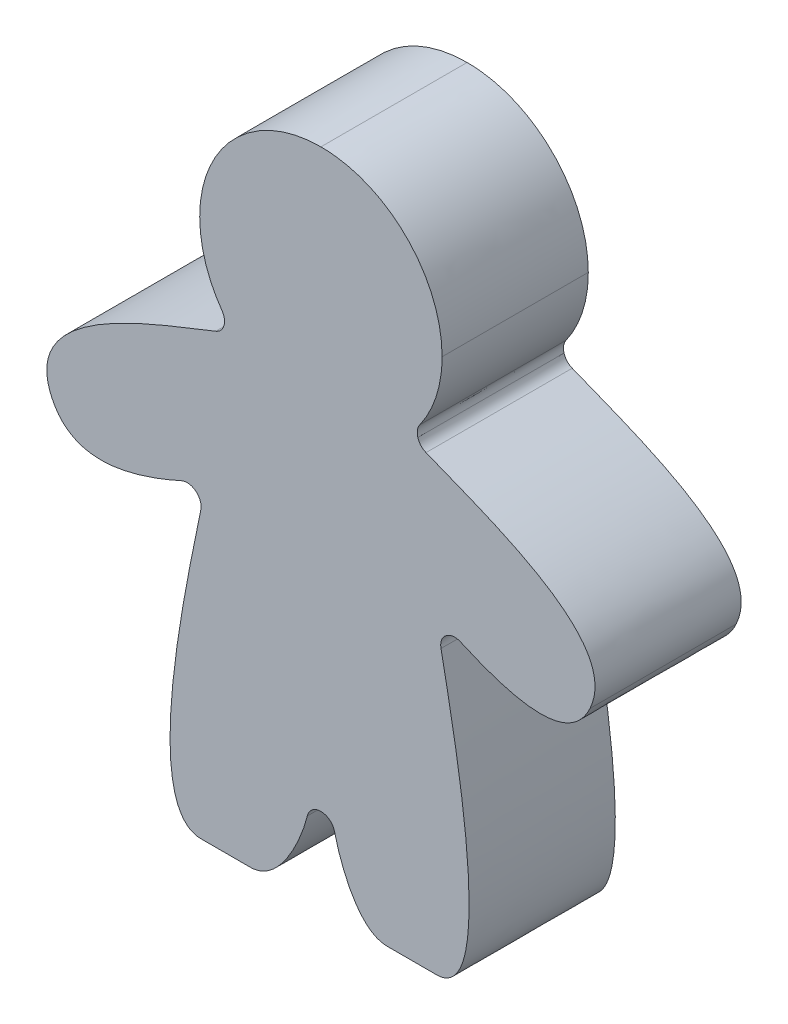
ISO-10303-21;
HEADER;
FILE_DESCRIPTION(('STEP AP214'),'2;1');
FILE_NAME('part.step','',(''),(''),'','','');
FILE_SCHEMA(('AUTOMOTIVE_DESIGN { 1 0 10303 214 1 1 1 1 }'));
ENDSEC;
DATA;
#1=APPLICATION_CONTEXT('core data for automotive mechanical design processes');
#2=APPLICATION_PROTOCOL_DEFINITION('international standard','automotive_design',2000,#1);
#3=PRODUCT_CONTEXT('',#1,'mechanical');
#4=PRODUCT('Part','Part','',(#3));
#5=PRODUCT_RELATED_PRODUCT_CATEGORY('part','',(#4));
#6=PRODUCT_DEFINITION_FORMATION('','',#4);
#7=PRODUCT_DEFINITION_CONTEXT('part definition',#1,'design');
#8=PRODUCT_DEFINITION('design','',#6,#7);
#9=PRODUCT_DEFINITION_SHAPE('','',#8);
#10=(LENGTH_UNIT() NAMED_UNIT(*) SI_UNIT(.MILLI.,.METRE.));
#11=(NAMED_UNIT(*) PLANE_ANGLE_UNIT() SI_UNIT($,.RADIAN.));
#12=(NAMED_UNIT(*) SI_UNIT($,.STERADIAN.) SOLID_ANGLE_UNIT());
#13=UNCERTAINTY_MEASURE_WITH_UNIT(LENGTH_MEASURE(1.E-05),#10,'distance_accuracy_value','');
#14=(GEOMETRIC_REPRESENTATION_CONTEXT(3) GLOBAL_UNCERTAINTY_ASSIGNED_CONTEXT((#13)) GLOBAL_UNIT_ASSIGNED_CONTEXT((#10,
#11,#12)) REPRESENTATION_CONTEXT('',''));
#15=CARTESIAN_POINT('',(0.,0.,0.));
#16=DIRECTION('',(0.,0.,1.));
#17=DIRECTION('',(1.,0.,0.));
#18=AXIS2_PLACEMENT_3D('',#15,#16,#17);
#19=CARTESIAN_POINT('',(385.575798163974,251.49269934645,8.));
#20=CARTESIAN_POINT('',(389.058798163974,251.49269934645,8.));
#21=CARTESIAN_POINT('',(386.499798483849,263.59589783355,8.));
#22=CARTESIAN_POINT('',(385.825498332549,267.07949847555,8.));
#23=B_SPLINE_CURVE_WITH_KNOTS('',3,(#19,#20,#21,#22),.UNSPECIFIED.,.F.,.F.,(4,4),(0.92000001,
1.),.UNSPECIFIED.);
#24=DIRECTION('',(0.,0.,-1.));
#25=VECTOR('',#24,1.);
#26=SURFACE_OF_LINEAR_EXTRUSION('',#23,#25);
#27=CARTESIAN_POINT('',(385.575798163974,251.49269934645,0.));
#28=CARTESIAN_POINT('',(389.058798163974,251.49269934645,0.));
#29=CARTESIAN_POINT('',(386.499798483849,263.59589783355,0.));
#30=CARTESIAN_POINT('',(385.825498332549,267.07949847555,0.));
#31=B_SPLINE_CURVE_WITH_KNOTS('',3,(#27,#28,#29,#30),.UNSPECIFIED.,.F.,.F.,(4,4),(0.92000001,
1.),.UNSPECIFIED.);
#32=CARTESIAN_POINT('',(385.575798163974,251.49269934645,0.));
#33=VERTEX_POINT('',#32);
#34=CARTESIAN_POINT('',(385.825498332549,267.07949847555,0.));
#35=VERTEX_POINT('',#34);
#36=EDGE_CURVE('E470',#33,#35,#31,.T.);
#37=ORIENTED_EDGE('',*,*,#36,.T.);
#38=DIRECTION('',(0.,0.,-1.));
#39=VECTOR('',#38,1.);
#40=CARTESIAN_POINT('',(385.825498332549,267.07949847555,8.));
#41=LINE('',#40,#39);
#42=CARTESIAN_POINT('',(385.825498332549,267.07949847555,8.));
#43=VERTEX_POINT('',#42);
#44=EDGE_CURVE('E11',#43,#35,#41,.T.);
#45=ORIENTED_EDGE('',*,*,#44,.F.);
#46=CARTESIAN_POINT('',(385.575798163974,251.49269934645,8.));
#47=VERTEX_POINT('',#46);
#48=EDGE_CURVE('E446',#47,#43,#23,.T.);
#49=ORIENTED_EDGE('',*,*,#48,.F.);
#50=DIRECTION('',(0.,0.,-1.));
#51=VECTOR('',#50,1.);
#52=CARTESIAN_POINT('',(385.575798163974,251.49269934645,8.));
#53=LINE('',#52,#51);
#54=EDGE_CURVE('E221',#47,#33,#53,.T.);
#55=ORIENTED_EDGE('',*,*,#54,.T.);
#56=EDGE_LOOP('',(#37,#45,#49,#55));
#57=FACE_BOUND('',#56,.T.);
#58=ADVANCED_FACE('F32',(#57),#26,.F.);
#59=CARTESIAN_POINT('',(385.825498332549,267.07949847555,8.));
#60=CARTESIAN_POINT('',(385.769798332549,267.36779847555,8.));
#61=CARTESIAN_POINT('',(385.872098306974,267.644098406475,8.));
#62=CARTESIAN_POINT('',(386.102298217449,267.82649838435,8.));
#63=B_SPLINE_CURVE_WITH_KNOTS('',3,(#59,#60,#61,#62),.UNSPECIFIED.,.F.,.F.,(4,4),(0.88000001,
0.92),.UNSPECIFIED.);
#64=DIRECTION('',(0.,0.,-1.));
#65=VECTOR('',#64,1.);
#66=SURFACE_OF_LINEAR_EXTRUSION('',#63,#65);
#67=CARTESIAN_POINT('',(385.825498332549,267.07949847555,0.));
#68=CARTESIAN_POINT('',(385.769798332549,267.36779847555,0.));
#69=CARTESIAN_POINT('',(385.872098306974,267.644098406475,0.));
#70=CARTESIAN_POINT('',(386.102298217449,267.82649838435,0.));
#71=B_SPLINE_CURVE_WITH_KNOTS('',3,(#67,#68,#69,#70),.UNSPECIFIED.,.F.,.F.,(4,4),(0.88000001,
0.92),.UNSPECIFIED.);
#72=CARTESIAN_POINT('',(386.102298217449,267.82649838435,0.));
#73=VERTEX_POINT('',#72);
#74=EDGE_CURVE('E461',#35,#73,#71,.T.);
#75=ORIENTED_EDGE('',*,*,#74,.T.);
#76=DIRECTION('',(0.,0.,-1.));
#77=VECTOR('',#76,1.);
#78=CARTESIAN_POINT('',(386.102298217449,267.82649838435,8.));
#79=LINE('',#78,#77);
#80=CARTESIAN_POINT('',(386.102298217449,267.82649838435,8.));
#81=VERTEX_POINT('',#80);
#82=EDGE_CURVE('E41',#81,#73,#79,.T.);
#83=ORIENTED_EDGE('',*,*,#82,.F.);
#84=EDGE_CURVE('E140',#43,#81,#63,.T.);
#85=ORIENTED_EDGE('',*,*,#84,.F.);
#86=ORIENTED_EDGE('',*,*,#44,.T.);
#87=EDGE_LOOP('',(#75,#83,#85,#86));
#88=FACE_BOUND('',#87,.T.);
#89=ADVANCED_FACE('F453',(#88),#66,.F.);
#90=CARTESIAN_POINT('',(386.102298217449,267.82649838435,8.));
#91=CARTESIAN_POINT('',(386.332598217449,268.00879838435,8.));
#92=CARTESIAN_POINT('',(386.624998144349,268.04519837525,8.));
#93=CARTESIAN_POINT('',(386.892898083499,267.92479844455,8.));
#94=B_SPLINE_CURVE_WITH_KNOTS('',3,(#90,#91,#92,#93),.UNSPECIFIED.,.F.,.F.,(4,4),(0.84000001,
0.88),.UNSPECIFIED.);
#95=DIRECTION('',(0.,0.,-1.));
#96=VECTOR('',#95,1.);
#97=SURFACE_OF_LINEAR_EXTRUSION('',#94,#96);
#98=CARTESIAN_POINT('',(386.102298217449,267.82649838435,0.));
#99=CARTESIAN_POINT('',(386.332598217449,268.00879838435,0.));
#100=CARTESIAN_POINT('',(386.624998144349,268.04519837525,0.));
#101=CARTESIAN_POINT('',(386.892898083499,267.92479844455,0.));
#102=B_SPLINE_CURVE_WITH_KNOTS('',3,(#98,#99,#100,#101),.UNSPECIFIED.,.F.,.F.,(4,4),(0.84000001,
0.88),.UNSPECIFIED.);
#103=CARTESIAN_POINT('',(386.892898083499,267.92479844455,0.));
#104=VERTEX_POINT('',#103);
#105=EDGE_CURVE('E469',#73,#104,#102,.T.);
#106=ORIENTED_EDGE('',*,*,#105,.T.);
#107=DIRECTION('',(0.,0.,-1.));
#108=VECTOR('',#107,1.);
#109=CARTESIAN_POINT('',(386.892898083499,267.92479844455,8.));
#110=LINE('',#109,#108);
#111=CARTESIAN_POINT('',(386.892898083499,267.92479844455,8.));
#112=VERTEX_POINT('',#111);
#113=EDGE_CURVE('E474',#112,#104,#110,.T.);
#114=ORIENTED_EDGE('',*,*,#113,.F.);
#115=EDGE_CURVE('E432',#81,#112,#94,.T.);
#116=ORIENTED_EDGE('',*,*,#115,.F.);
#117=ORIENTED_EDGE('',*,*,#82,.T.);
#118=EDGE_LOOP('',(#106,#114,#116,#117));
#119=FACE_BOUND('',#118,.T.);
#120=ADVANCED_FACE('F425',(#119),#97,.F.);
#121=CARTESIAN_POINT('',(386.892898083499,267.92479844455,8.));
#122=CARTESIAN_POINT('',(389.825898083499,266.60719844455,8.));
#123=CARTESIAN_POINT('',(392.843197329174,265.880298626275,8.));
#124=CARTESIAN_POINT('',(393.975197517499,268.3079972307,8.));
#125=B_SPLINE_CURVE_WITH_KNOTS('',3,(#121,#122,#123,#124),.UNSPECIFIED.,.F.,.F.,(4,4),
(0.80000001,0.84),.UNSPECIFIED.);
#126=DIRECTION('',(0.,0.,-1.));
#127=VECTOR('',#126,1.);
#128=SURFACE_OF_LINEAR_EXTRUSION('',#125,#127);
#129=CARTESIAN_POINT('',(386.892898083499,267.92479844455,0.));
#130=CARTESIAN_POINT('',(389.825898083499,266.60719844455,0.));
#131=CARTESIAN_POINT('',(392.843197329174,265.880298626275,0.));
#132=CARTESIAN_POINT('',(393.975197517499,268.3079972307,0.));
#133=B_SPLINE_CURVE_WITH_KNOTS('',3,(#129,#130,#131,#132),.UNSPECIFIED.,.F.,.F.,(4,4),
(0.80000001,0.84),.UNSPECIFIED.);
#134=CARTESIAN_POINT('',(393.975197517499,268.3079972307,0.));
#135=VERTEX_POINT('',#134);
#136=EDGE_CURVE('E478',#104,#135,#133,.T.);
#137=ORIENTED_EDGE('',*,*,#136,.T.);
#138=DIRECTION('',(0.,0.,-1.));
#139=VECTOR('',#138,1.);
#140=CARTESIAN_POINT('',(393.975197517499,268.3079972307,8.));
#141=LINE('',#140,#139);
#142=CARTESIAN_POINT('',(393.975197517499,268.3079972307,8.));
#143=VERTEX_POINT('',#142);
#144=EDGE_CURVE('E677',#143,#135,#141,.T.);
#145=ORIENTED_EDGE('',*,*,#144,.F.);
#146=EDGE_CURVE('E428',#112,#143,#125,.T.);
#147=ORIENTED_EDGE('',*,*,#146,.F.);
#148=ORIENTED_EDGE('',*,*,#113,.T.);
#149=EDGE_LOOP('',(#137,#145,#147,#148));
#150=FACE_BOUND('',#149,.T.);
#151=ADVANCED_FACE('F421',(#150),#128,.F.);
#152=CARTESIAN_POINT('',(393.975197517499,268.3079972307,8.));
#153=CARTESIAN_POINT('',(395.747597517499,272.1088972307,8.));
#154=CARTESIAN_POINT('',(388.626999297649,274.4792966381,8.));
#155=CARTESIAN_POINT('',(385.006399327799,275.9536964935,8.));
#156=B_SPLINE_CURVE_WITH_KNOTS('',3,(#152,#153,#154,#155),.UNSPECIFIED.,.F.,.F.,(4,4),
(0.76000001,0.8),.UNSPECIFIED.);
#157=DIRECTION('',(0.,0.,-1.));
#158=VECTOR('',#157,1.);
#159=SURFACE_OF_LINEAR_EXTRUSION('',#156,#158);
#160=CARTESIAN_POINT('',(393.975197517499,268.3079972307,0.));
#161=CARTESIAN_POINT('',(395.747597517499,272.1088972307,0.));
#162=CARTESIAN_POINT('',(388.626999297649,274.4792966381,0.));
#163=CARTESIAN_POINT('',(385.006399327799,275.9536964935,0.));
#164=B_SPLINE_CURVE_WITH_KNOTS('',3,(#160,#161,#162,#163),.UNSPECIFIED.,.F.,.F.,(4,4),
(0.76000001,0.8),.UNSPECIFIED.);
#165=CARTESIAN_POINT('',(385.006399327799,275.9536964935,0.));
#166=VERTEX_POINT('',#165);
#167=EDGE_CURVE('E480',#135,#166,#164,.T.);
#168=ORIENTED_EDGE('',*,*,#167,.T.);
#169=DIRECTION('',(0.,0.,-1.));
#170=VECTOR('',#169,1.);
#171=CARTESIAN_POINT('',(385.006399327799,275.9536964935,8.));
#172=LINE('',#171,#170);
#173=CARTESIAN_POINT('',(385.006399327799,275.9536964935,8.));
#174=VERTEX_POINT('',#173);
#175=EDGE_CURVE('E674',#174,#166,#172,.T.);
#176=ORIENTED_EDGE('',*,*,#175,.F.);
#177=EDGE_CURVE('E406',#143,#174,#156,.T.);
#178=ORIENTED_EDGE('',*,*,#177,.F.);
#179=ORIENTED_EDGE('',*,*,#144,.T.);
#180=EDGE_LOOP('',(#168,#176,#178,#179));
#181=FACE_BOUND('',#180,.T.);
#182=ADVANCED_FACE('F417',(#181),#159,.F.);
#183=CARTESIAN_POINT('',(385.006399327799,275.9536964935,8.));
#184=CARTESIAN_POINT('',(384.782299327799,276.0450964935,8.));
#185=CARTESIAN_POINT('',(384.627399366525,276.21689645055,8.));
#186=CARTESIAN_POINT('',(384.559599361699,276.44919637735,8.));
#187=B_SPLINE_CURVE_WITH_KNOTS('',3,(#183,#184,#185,#186),.UNSPECIFIED.,.F.,.F.,(4,4),
(0.72000001,0.76),.UNSPECIFIED.);
#188=DIRECTION('',(0.,0.,-1.));
#189=VECTOR('',#188,1.);
#190=SURFACE_OF_LINEAR_EXTRUSION('',#187,#189);
#191=CARTESIAN_POINT('',(385.006399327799,275.9536964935,0.));
#192=CARTESIAN_POINT('',(384.782299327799,276.0450964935,0.));
#193=CARTESIAN_POINT('',(384.627399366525,276.21689645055,0.));
#194=CARTESIAN_POINT('',(384.559599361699,276.44919637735,0.));
#195=B_SPLINE_CURVE_WITH_KNOTS('',3,(#191,#192,#193,#194),.UNSPECIFIED.,.F.,.F.,(4,4),
(0.72000001,0.76),.UNSPECIFIED.);
#196=CARTESIAN_POINT('',(384.559599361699,276.44919637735,0.));
#197=VERTEX_POINT('',#196);
#198=EDGE_CURVE('E498',#166,#197,#195,.T.);
#199=ORIENTED_EDGE('',*,*,#198,.T.);
#200=DIRECTION('',(0.,0.,-1.));
#201=VECTOR('',#200,1.);
#202=CARTESIAN_POINT('',(384.559599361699,276.44919637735,8.));
#203=LINE('',#202,#201);
#204=CARTESIAN_POINT('',(384.559599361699,276.44919637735,8.));
#205=VERTEX_POINT('',#204);
#206=EDGE_CURVE('E671',#205,#197,#203,.T.);
#207=ORIENTED_EDGE('',*,*,#206,.F.);
#208=EDGE_CURVE('E398',#174,#205,#187,.T.);
#209=ORIENTED_EDGE('',*,*,#208,.F.);
#210=ORIENTED_EDGE('',*,*,#175,.T.);
#211=EDGE_LOOP('',(#199,#207,#209,#210));
#212=FACE_BOUND('',#211,.T.);
#213=ADVANCED_FACE('F414',(#212),#190,.F.);
#214=CARTESIAN_POINT('',(384.559599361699,276.44919637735,8.));
#215=CARTESIAN_POINT('',(384.491799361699,276.68159637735,8.));
#216=CARTESIAN_POINT('',(384.529999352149,276.9097963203,8.));
#217=CARTESIAN_POINT('',(384.669899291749,277.1072962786,8.));
#218=B_SPLINE_CURVE_WITH_KNOTS('',3,(#214,#215,#216,#217),.UNSPECIFIED.,.F.,.F.,(4,4),
(0.68000001,0.72),.UNSPECIFIED.);
#219=DIRECTION('',(0.,0.,-1.));
#220=VECTOR('',#219,1.);
#221=SURFACE_OF_LINEAR_EXTRUSION('',#218,#220);
#222=CARTESIAN_POINT('',(384.559599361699,276.44919637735,0.));
#223=CARTESIAN_POINT('',(384.491799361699,276.68159637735,0.));
#224=CARTESIAN_POINT('',(384.529999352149,276.9097963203,0.));
#225=CARTESIAN_POINT('',(384.669899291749,277.1072962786,0.));
#226=B_SPLINE_CURVE_WITH_KNOTS('',3,(#222,#223,#224,#225),.UNSPECIFIED.,.F.,.F.,(4,4),
(0.68000001,0.72),.UNSPECIFIED.);
#227=CARTESIAN_POINT('',(384.669899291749,277.1072962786,0.));
#228=VERTEX_POINT('',#227);
#229=EDGE_CURVE('E505',#197,#228,#226,.T.);
#230=ORIENTED_EDGE('',*,*,#229,.T.);
#231=DIRECTION('',(0.,0.,-1.));
#232=VECTOR('',#231,1.);
#233=CARTESIAN_POINT('',(384.669899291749,277.1072962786,8.));
#234=LINE('',#233,#232);
#235=CARTESIAN_POINT('',(384.669899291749,277.1072962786,8.));
#236=VERTEX_POINT('',#235);
#237=EDGE_CURVE('E668',#236,#228,#234,.T.);
#238=ORIENTED_EDGE('',*,*,#237,.F.);
#239=EDGE_CURVE('E390',#205,#236,#218,.T.);
#240=ORIENTED_EDGE('',*,*,#239,.F.);
#241=ORIENTED_EDGE('',*,*,#206,.T.);
#242=EDGE_LOOP('',(#230,#238,#240,#241));
#243=FACE_BOUND('',#242,.T.);
#244=ADVANCED_FACE('F382',(#243),#221,.F.);
#245=CARTESIAN_POINT('',(384.669899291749,277.1072962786,8.));
#246=CARTESIAN_POINT('',(385.435799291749,278.1887962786,8.));
#247=CARTESIAN_POINT('',(385.885999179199,279.50979594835,8.));
#248=CARTESIAN_POINT('',(385.885999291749,280.93589556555,8.));
#249=B_SPLINE_CURVE_WITH_KNOTS('',3,(#245,#246,#247,#248),.UNSPECIFIED.,.F.,.F.,(4,4),
(0.64000001,0.68),.UNSPECIFIED.);
#250=DIRECTION('',(0.,0.,-1.));
#251=VECTOR('',#250,1.);
#252=SURFACE_OF_LINEAR_EXTRUSION('',#249,#251);
#253=CARTESIAN_POINT('',(384.669899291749,277.1072962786,0.));
#254=CARTESIAN_POINT('',(385.435799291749,278.1887962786,0.));
#255=CARTESIAN_POINT('',(385.885999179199,279.50979594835,0.));
#256=CARTESIAN_POINT('',(385.885999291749,280.93589556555,0.));
#257=B_SPLINE_CURVE_WITH_KNOTS('',3,(#253,#254,#255,#256),.UNSPECIFIED.,.F.,.F.,(4,4),
(0.64000001,0.68),.UNSPECIFIED.);
#258=CARTESIAN_POINT('',(385.885999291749,280.93589556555,0.));
#259=VERTEX_POINT('',#258);
#260=EDGE_CURVE('E512',#228,#259,#257,.T.);
#261=ORIENTED_EDGE('',*,*,#260,.T.);
#262=DIRECTION('',(0.,0.,-1.));
#263=VECTOR('',#262,1.);
#264=CARTESIAN_POINT('',(385.885999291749,280.93589556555,8.));
#265=LINE('',#264,#263);
#266=CARTESIAN_POINT('',(385.885999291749,280.93589556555,8.));
#267=VERTEX_POINT('',#266);
#268=EDGE_CURVE('E665',#267,#259,#265,.T.);
#269=ORIENTED_EDGE('',*,*,#268,.F.);
#270=EDGE_CURVE('E386',#236,#267,#249,.T.);
#271=ORIENTED_EDGE('',*,*,#270,.F.);
#272=ORIENTED_EDGE('',*,*,#237,.T.);
#273=EDGE_LOOP('',(#261,#269,#271,#272));
#274=FACE_BOUND('',#273,.T.);
#275=ADVANCED_FACE('F378',(#274),#252,.F.);
#276=CARTESIAN_POINT('',(385.885999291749,280.93589556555,8.));
#277=CARTESIAN_POINT('',(385.885999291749,284.59869556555,8.));
#278=CARTESIAN_POINT('',(382.916700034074,287.56789482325,8.));
#279=CARTESIAN_POINT('',(379.253901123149,287.56789556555,8.));
#280=B_SPLINE_CURVE_WITH_KNOTS('',3,(#276,#277,#278,#279),.UNSPECIFIED.,.F.,.F.,(4,4),
(0.60000001,0.64),.UNSPECIFIED.);
#281=DIRECTION('',(0.,0.,-1.));
#282=VECTOR('',#281,1.);
#283=SURFACE_OF_LINEAR_EXTRUSION('',#280,#282);
#284=CARTESIAN_POINT('',(385.885999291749,280.93589556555,0.));
#285=CARTESIAN_POINT('',(385.885999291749,284.59869556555,0.));
#286=CARTESIAN_POINT('',(382.916700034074,287.56789482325,0.));
#287=CARTESIAN_POINT('',(379.253901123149,287.56789556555,0.));
#288=B_SPLINE_CURVE_WITH_KNOTS('',3,(#284,#285,#286,#287),.UNSPECIFIED.,.F.,.F.,(4,4),
(0.60000001,0.64),.UNSPECIFIED.);
#289=CARTESIAN_POINT('',(379.253901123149,287.56789556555,0.));
#290=VERTEX_POINT('',#289);
#291=EDGE_CURVE('E519',#259,#290,#288,.T.);
#292=ORIENTED_EDGE('',*,*,#291,.T.);
#293=DIRECTION('',(0.,0.,-1.));
#294=VECTOR('',#293,1.);
#295=CARTESIAN_POINT('',(379.253901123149,287.56789556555,8.));
#296=LINE('',#295,#294);
#297=CARTESIAN_POINT('',(379.253901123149,287.56789556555,8.));
#298=VERTEX_POINT('',#297);
#299=EDGE_CURVE('E662',#298,#290,#296,.T.);
#300=ORIENTED_EDGE('',*,*,#299,.F.);
#301=EDGE_CURVE('E363',#267,#298,#280,.T.);
#302=ORIENTED_EDGE('',*,*,#301,.F.);
#303=ORIENTED_EDGE('',*,*,#268,.T.);
#304=EDGE_LOOP('',(#292,#300,#302,#303));
#305=FACE_BOUND('',#304,.T.);
#306=ADVANCED_FACE('F374',(#305),#283,.F.);
#307=CARTESIAN_POINT('',(379.253901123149,287.56789556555,8.));
#308=CARTESIAN_POINT('',(375.591201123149,287.56789556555,8.));
#309=CARTESIAN_POINT('',(372.621901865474,284.59869630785,8.));
#310=CARTESIAN_POINT('',(372.621901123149,280.93589739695,8.));
#311=B_SPLINE_CURVE_WITH_KNOTS('',3,(#307,#308,#309,#310),.UNSPECIFIED.,.F.,.F.,(4,4),
(0.56000001,0.6),.UNSPECIFIED.);
#312=DIRECTION('',(0.,0.,-1.));
#313=VECTOR('',#312,1.);
#314=SURFACE_OF_LINEAR_EXTRUSION('',#311,#313);
#315=CARTESIAN_POINT('',(379.253901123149,287.56789556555,0.));
#316=CARTESIAN_POINT('',(375.591201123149,287.56789556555,0.));
#317=CARTESIAN_POINT('',(372.621901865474,284.59869630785,0.));
#318=CARTESIAN_POINT('',(372.621901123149,280.93589739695,0.));
#319=B_SPLINE_CURVE_WITH_KNOTS('',3,(#315,#316,#317,#318),.UNSPECIFIED.,.F.,.F.,(4,4),
(0.56000001,0.6),.UNSPECIFIED.);
#320=CARTESIAN_POINT('',(372.621901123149,280.93589739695,0.));
#321=VERTEX_POINT('',#320);
#322=EDGE_CURVE('E526',#290,#321,#319,.T.);
#323=ORIENTED_EDGE('',*,*,#322,.T.);
#324=DIRECTION('',(0.,0.,-1.));
#325=VECTOR('',#324,1.);
#326=CARTESIAN_POINT('',(372.621901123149,280.93589739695,8.));
#327=LINE('',#326,#325);
#328=CARTESIAN_POINT('',(372.621901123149,280.93589739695,8.));
#329=VERTEX_POINT('',#328);
#330=EDGE_CURVE('E659',#329,#321,#327,.T.);
#331=ORIENTED_EDGE('',*,*,#330,.F.);
#332=EDGE_CURVE('E355',#298,#329,#311,.T.);
#333=ORIENTED_EDGE('',*,*,#332,.F.);
#334=ORIENTED_EDGE('',*,*,#299,.T.);
#335=EDGE_LOOP('',(#323,#331,#333,#334));
#336=FACE_BOUND('',#335,.T.);
#337=ADVANCED_FACE('F371',(#336),#314,.F.);
#338=CARTESIAN_POINT('',(372.621901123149,280.93589739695,8.));
#339=CARTESIAN_POINT('',(372.621901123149,279.50979739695,8.));
#340=CARTESIAN_POINT('',(373.072001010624,278.1887977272,8.));
#341=CARTESIAN_POINT('',(373.838000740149,277.1072979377,8.));
#342=B_SPLINE_CURVE_WITH_KNOTS('',3,(#338,#339,#340,#341),.UNSPECIFIED.,.F.,.F.,(4,4),
(0.52000001,0.56),.UNSPECIFIED.);
#343=DIRECTION('',(0.,0.,-1.));
#344=VECTOR('',#343,1.);
#345=SURFACE_OF_LINEAR_EXTRUSION('',#342,#344);
#346=CARTESIAN_POINT('',(372.621901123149,280.93589739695,0.));
#347=CARTESIAN_POINT('',(372.621901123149,279.50979739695,0.));
#348=CARTESIAN_POINT('',(373.072001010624,278.1887977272,0.));
#349=CARTESIAN_POINT('',(373.838000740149,277.1072979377,0.));
#350=B_SPLINE_CURVE_WITH_KNOTS('',3,(#346,#347,#348,#349),.UNSPECIFIED.,.F.,.F.,(4,4),
(0.52000001,0.56),.UNSPECIFIED.);
#351=CARTESIAN_POINT('',(373.838000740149,277.1072979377,0.));
#352=VERTEX_POINT('',#351);
#353=EDGE_CURVE('E533',#321,#352,#350,.T.);
#354=ORIENTED_EDGE('',*,*,#353,.T.);
#355=DIRECTION('',(0.,0.,-1.));
#356=VECTOR('',#355,1.);
#357=CARTESIAN_POINT('',(373.838000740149,277.1072979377,8.));
#358=LINE('',#357,#356);
#359=CARTESIAN_POINT('',(373.838000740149,277.1072979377,8.));
#360=VERTEX_POINT('',#359);
#361=EDGE_CURVE('E656',#360,#352,#358,.T.);
#362=ORIENTED_EDGE('',*,*,#361,.F.);
#363=EDGE_CURVE('E347',#329,#360,#342,.T.);
#364=ORIENTED_EDGE('',*,*,#363,.F.);
#365=ORIENTED_EDGE('',*,*,#330,.T.);
#366=EDGE_LOOP('',(#354,#362,#364,#365));
#367=FACE_BOUND('',#366,.T.);
#368=ADVANCED_FACE('F339',(#367),#345,.F.);
#369=CARTESIAN_POINT('',(373.838000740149,277.1072979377,8.));
#370=CARTESIAN_POINT('',(373.977900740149,276.9097979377,8.));
#371=CARTESIAN_POINT('',(374.016200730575,276.68159799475,8.));
#372=CARTESIAN_POINT('',(373.9483007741,276.4491980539,8.));
#373=B_SPLINE_CURVE_WITH_KNOTS('',3,(#369,#370,#371,#372),.UNSPECIFIED.,.F.,.F.,(4,4),
(0.48000001,0.52),.UNSPECIFIED.);
#374=DIRECTION('',(0.,0.,-1.));
#375=VECTOR('',#374,1.);
#376=SURFACE_OF_LINEAR_EXTRUSION('',#373,#375);
#377=CARTESIAN_POINT('',(373.838000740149,277.1072979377,0.));
#378=CARTESIAN_POINT('',(373.977900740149,276.9097979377,0.));
#379=CARTESIAN_POINT('',(374.016200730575,276.68159799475,0.));
#380=CARTESIAN_POINT('',(373.9483007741,276.4491980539,0.));
#381=B_SPLINE_CURVE_WITH_KNOTS('',3,(#377,#378,#379,#380),.UNSPECIFIED.,.F.,.F.,(4,4),
(0.48000001,0.52),.UNSPECIFIED.);
#382=CARTESIAN_POINT('',(373.9483007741,276.4491980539,0.));
#383=VERTEX_POINT('',#382);
#384=EDGE_CURVE('E540',#352,#383,#381,.T.);
#385=ORIENTED_EDGE('',*,*,#384,.T.);
#386=DIRECTION('',(0.,0.,-1.));
#387=VECTOR('',#386,1.);
#388=CARTESIAN_POINT('',(373.9483007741,276.4491980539,8.));
#389=LINE('',#388,#387);
#390=CARTESIAN_POINT('',(373.9483007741,276.4491980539,8.));
#391=VERTEX_POINT('',#390);
#392=EDGE_CURVE('E653',#391,#383,#389,.T.);
#393=ORIENTED_EDGE('',*,*,#392,.F.);
#394=EDGE_CURVE('E343',#360,#391,#373,.T.);
#395=ORIENTED_EDGE('',*,*,#394,.F.);
#396=ORIENTED_EDGE('',*,*,#361,.T.);
#397=EDGE_LOOP('',(#385,#393,#395,#396));
#398=FACE_BOUND('',#397,.T.);
#399=ADVANCED_FACE('F335',(#398),#376,.F.);
#400=CARTESIAN_POINT('',(373.9483007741,276.4491980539,8.));
#401=CARTESIAN_POINT('',(373.8805007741,276.2167980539,8.));
#402=CARTESIAN_POINT('',(373.7257008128,276.04499809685,8.));
#403=CARTESIAN_POINT('',(373.5015008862,275.9535980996,8.));
#404=B_SPLINE_CURVE_WITH_KNOTS('',3,(#400,#401,#402,#403),.UNSPECIFIED.,.F.,.F.,(4,4),
(0.44000001,0.48),.UNSPECIFIED.);
#405=DIRECTION('',(0.,0.,-1.));
#406=VECTOR('',#405,1.);
#407=SURFACE_OF_LINEAR_EXTRUSION('',#404,#406);
#408=CARTESIAN_POINT('',(373.9483007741,276.4491980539,0.));
#409=CARTESIAN_POINT('',(373.8805007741,276.2167980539,0.));
#410=CARTESIAN_POINT('',(373.7257008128,276.04499809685,0.));
#411=CARTESIAN_POINT('',(373.5015008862,275.9535980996,0.));
#412=B_SPLINE_CURVE_WITH_KNOTS('',3,(#408,#409,#410,#411),.UNSPECIFIED.,.F.,.F.,(4,4),
(0.44000001,0.48),.UNSPECIFIED.);
#413=CARTESIAN_POINT('',(373.5015008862,275.9535980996,0.));
#414=VERTEX_POINT('',#413);
#415=EDGE_CURVE('E547',#383,#414,#412,.T.);
#416=ORIENTED_EDGE('',*,*,#415,.T.);
#417=DIRECTION('',(0.,0.,-1.));
#418=VECTOR('',#417,1.);
#419=CARTESIAN_POINT('',(373.5015008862,275.9535980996,8.));
#420=LINE('',#419,#418);
#421=CARTESIAN_POINT('',(373.5015008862,275.9535980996,8.));
#422=VERTEX_POINT('',#421);
#423=EDGE_CURVE('E650',#422,#414,#420,.T.);
#424=ORIENTED_EDGE('',*,*,#423,.F.);
#425=EDGE_CURVE('E320',#391,#422,#404,.T.);
#426=ORIENTED_EDGE('',*,*,#425,.F.);
#427=ORIENTED_EDGE('',*,*,#392,.T.);
#428=EDGE_LOOP('',(#416,#424,#426,#427));
#429=FACE_BOUND('',#428,.T.);
#430=ADVANCED_FACE('F331',(#429),#407,.F.);
#431=CARTESIAN_POINT('',(373.5015008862,275.9535980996,8.));
#432=CARTESIAN_POINT('',(369.880800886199,274.4792980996,8.));
#433=CARTESIAN_POINT('',(362.760302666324,272.1088986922,8.));
#434=CARTESIAN_POINT('',(364.5327,268.3081,8.));
#435=B_SPLINE_CURVE_WITH_KNOTS('',3,(#431,#432,#433,#434),.UNSPECIFIED.,.F.,.F.,(4,4),
(0.40000001,0.44),.UNSPECIFIED.);
#436=DIRECTION('',(0.,0.,-1.));
#437=VECTOR('',#436,1.);
#438=SURFACE_OF_LINEAR_EXTRUSION('',#435,#437);
#439=CARTESIAN_POINT('',(373.5015008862,275.9535980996,0.));
#440=CARTESIAN_POINT('',(369.880800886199,274.4792980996,0.));
#441=CARTESIAN_POINT('',(362.760302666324,272.1088986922,0.));
#442=CARTESIAN_POINT('',(364.5327,268.3081,0.));
#443=B_SPLINE_CURVE_WITH_KNOTS('',3,(#439,#440,#441,#442),.UNSPECIFIED.,.F.,.F.,(4,4),
(0.40000001,0.44),.UNSPECIFIED.);
#444=CARTESIAN_POINT('',(364.5327,268.3081,0.));
#445=VERTEX_POINT('',#444);
#446=EDGE_CURVE('E554',#414,#445,#443,.T.);
#447=ORIENTED_EDGE('',*,*,#446,.T.);
#448=DIRECTION('',(0.,0.,-1.));
#449=VECTOR('',#448,1.);
#450=CARTESIAN_POINT('',(364.5327,268.3081,8.));
#451=LINE('',#450,#449);
#452=CARTESIAN_POINT('',(364.5327,268.3081,8.));
#453=VERTEX_POINT('',#452);
#454=EDGE_CURVE('E647',#453,#445,#451,.T.);
#455=ORIENTED_EDGE('',*,*,#454,.F.);
#456=EDGE_CURVE('E312',#422,#453,#435,.T.);
#457=ORIENTED_EDGE('',*,*,#456,.F.);
#458=ORIENTED_EDGE('',*,*,#423,.T.);
#459=EDGE_LOOP('',(#447,#455,#457,#458));
#460=FACE_BOUND('',#459,.T.);
#461=ADVANCED_FACE('F328',(#460),#438,.F.);
#462=CARTESIAN_POINT('',(364.5327,268.3081,8.));
#463=CARTESIAN_POINT('',(365.6647,265.8803,8.));
#464=CARTESIAN_POINT('',(368.681999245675,266.607199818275,8.));
#465=CARTESIAN_POINT('',(371.61509853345,267.92489934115,8.));
#466=B_SPLINE_CURVE_WITH_KNOTS('',3,(#462,#463,#464,#465),.UNSPECIFIED.,.F.,.F.,(4,4),
(0.36000001,0.4),.UNSPECIFIED.);
#467=DIRECTION('',(0.,0.,-1.));
#468=VECTOR('',#467,1.);
#469=SURFACE_OF_LINEAR_EXTRUSION('',#466,#468);
#470=CARTESIAN_POINT('',(364.5327,268.3081,0.));
#471=CARTESIAN_POINT('',(365.6647,265.8803,0.));
#472=CARTESIAN_POINT('',(368.681999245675,266.607199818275,0.));
#473=CARTESIAN_POINT('',(371.61509853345,267.92489934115,0.));
#474=B_SPLINE_CURVE_WITH_KNOTS('',3,(#470,#471,#472,#473),.UNSPECIFIED.,.F.,.F.,(4,4),
(0.36000001,0.4),.UNSPECIFIED.);
#475=CARTESIAN_POINT('',(371.61509853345,267.92489934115,0.));
#476=VERTEX_POINT('',#475);
#477=EDGE_CURVE('E561',#445,#476,#474,.T.);
#478=ORIENTED_EDGE('',*,*,#477,.T.);
#479=DIRECTION('',(0.,0.,-1.));
#480=VECTOR('',#479,1.);
#481=CARTESIAN_POINT('',(371.61509853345,267.92489934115,8.));
#482=LINE('',#481,#480);
#483=CARTESIAN_POINT('',(371.61509853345,267.92489934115,8.));
#484=VERTEX_POINT('',#483);
#485=EDGE_CURVE('E644',#484,#476,#482,.T.);
#486=ORIENTED_EDGE('',*,*,#485,.F.);
#487=EDGE_CURVE('E304',#453,#484,#466,.T.);
#488=ORIENTED_EDGE('',*,*,#487,.F.);
#489=ORIENTED_EDGE('',*,*,#454,.T.);
#490=EDGE_LOOP('',(#478,#486,#488,#489));
#491=FACE_BOUND('',#490,.T.);
#492=ADVANCED_FACE('F296',(#491),#469,.F.);
#493=CARTESIAN_POINT('',(371.61509853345,267.92489934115,8.));
#494=CARTESIAN_POINT('',(371.88299853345,268.04529934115,8.));
#495=CARTESIAN_POINT('',(372.17539846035,268.00889935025,8.));
#496=CARTESIAN_POINT('',(372.40559841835,267.8265994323,8.));
#497=B_SPLINE_CURVE_WITH_KNOTS('',3,(#493,#494,#495,#496),.UNSPECIFIED.,.F.,.F.,(4,4),
(0.32000001,0.36),.UNSPECIFIED.);
#498=DIRECTION('',(0.,0.,-1.));
#499=VECTOR('',#498,1.);
#500=SURFACE_OF_LINEAR_EXTRUSION('',#497,#499);
#501=CARTESIAN_POINT('',(371.61509853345,267.92489934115,0.));
#502=CARTESIAN_POINT('',(371.88299853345,268.04529934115,0.));
#503=CARTESIAN_POINT('',(372.17539846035,268.00889935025,0.));
#504=CARTESIAN_POINT('',(372.40559841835,267.8265994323,0.));
#505=B_SPLINE_CURVE_WITH_KNOTS('',3,(#501,#502,#503,#504),.UNSPECIFIED.,.F.,.F.,(4,4),
(0.32000001,0.36),.UNSPECIFIED.);
#506=CARTESIAN_POINT('',(372.40559841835,267.8265994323,0.));
#507=VERTEX_POINT('',#506);
#508=EDGE_CURVE('E568',#476,#507,#505,.T.);
#509=ORIENTED_EDGE('',*,*,#508,.T.);
#510=DIRECTION('',(0.,0.,-1.));
#511=VECTOR('',#510,1.);
#512=CARTESIAN_POINT('',(372.40559841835,267.8265994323,8.));
#513=LINE('',#512,#511);
#514=CARTESIAN_POINT('',(372.40559841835,267.8265994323,8.));
#515=VERTEX_POINT('',#514);
#516=EDGE_CURVE('E641',#515,#507,#513,.T.);
#517=ORIENTED_EDGE('',*,*,#516,.F.);
#518=EDGE_CURVE('E300',#484,#515,#497,.T.);
#519=ORIENTED_EDGE('',*,*,#518,.F.);
#520=ORIENTED_EDGE('',*,*,#485,.T.);
#521=EDGE_LOOP('',(#509,#517,#519,#520));
#522=FACE_BOUND('',#521,.T.);
#523=ADVANCED_FACE('F292',(#522),#500,.F.);
#524=CARTESIAN_POINT('',(372.40559841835,267.8265994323,8.));
#525=CARTESIAN_POINT('',(372.63589841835,267.6441994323,8.));
#526=CARTESIAN_POINT('',(372.738198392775,267.367899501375,8.));
#527=CARTESIAN_POINT('',(372.6824984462,267.07959957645,8.));
#528=B_SPLINE_CURVE_WITH_KNOTS('',3,(#524,#525,#526,#527),.UNSPECIFIED.,.F.,.F.,(4,4),
(0.28000001,0.32),.UNSPECIFIED.);
#529=DIRECTION('',(0.,0.,-1.));
#530=VECTOR('',#529,1.);
#531=SURFACE_OF_LINEAR_EXTRUSION('',#528,#530);
#532=CARTESIAN_POINT('',(372.40559841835,267.8265994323,0.));
#533=CARTESIAN_POINT('',(372.63589841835,267.6441994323,0.));
#534=CARTESIAN_POINT('',(372.738198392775,267.367899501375,0.));
#535=CARTESIAN_POINT('',(372.6824984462,267.07959957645,0.));
#536=B_SPLINE_CURVE_WITH_KNOTS('',3,(#532,#533,#534,#535),.UNSPECIFIED.,.F.,.F.,(4,4),
(0.28000001,0.32),.UNSPECIFIED.);
#537=CARTESIAN_POINT('',(372.6824984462,267.07959957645,0.));
#538=VERTEX_POINT('',#537);
#539=EDGE_CURVE('E575',#507,#538,#536,.T.);
#540=ORIENTED_EDGE('',*,*,#539,.T.);
#541=DIRECTION('',(0.,0.,-1.));
#542=VECTOR('',#541,1.);
#543=CARTESIAN_POINT('',(372.6824984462,267.07959957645,8.));
#544=LINE('',#543,#542);
#545=CARTESIAN_POINT('',(372.6824984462,267.07959957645,8.));
#546=VERTEX_POINT('',#545);
#547=EDGE_CURVE('E638',#546,#538,#544,.T.);
#548=ORIENTED_EDGE('',*,*,#547,.F.);
#549=EDGE_CURVE('E275',#515,#546,#528,.T.);
#550=ORIENTED_EDGE('',*,*,#549,.F.);
#551=ORIENTED_EDGE('',*,*,#516,.T.);
#552=EDGE_LOOP('',(#540,#548,#550,#551));
#553=FACE_BOUND('',#552,.T.);
#554=ADVANCED_FACE('F288',(#553),#531,.F.);
#555=CARTESIAN_POINT('',(372.6824984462,267.07959957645,8.));
#556=CARTESIAN_POINT('',(372.1544984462,264.35209957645,8.));
#557=CARTESIAN_POINT('',(369.159299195,251.4927027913,8.));
#558=CARTESIAN_POINT('',(372.70199667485,251.492699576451,8.));
#559=B_SPLINE_CURVE_WITH_KNOTS('',3,(#555,#556,#557,#558),.UNSPECIFIED.,.F.,.F.,(4,4),
(0.24000001,0.28),.UNSPECIFIED.);
#560=DIRECTION('',(0.,0.,-1.));
#561=VECTOR('',#560,1.);
#562=SURFACE_OF_LINEAR_EXTRUSION('',#559,#561);
#563=CARTESIAN_POINT('',(372.6824984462,267.07959957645,0.));
#564=CARTESIAN_POINT('',(372.1544984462,264.35209957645,0.));
#565=CARTESIAN_POINT('',(369.159299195,251.4927027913,0.));
#566=CARTESIAN_POINT('',(372.70199667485,251.492699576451,0.));
#567=B_SPLINE_CURVE_WITH_KNOTS('',3,(#563,#564,#565,#566),.UNSPECIFIED.,.F.,.F.,(4,4),
(0.24000001,0.28),.UNSPECIFIED.);
#568=CARTESIAN_POINT('',(372.70199667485,251.492699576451,0.));
#569=VERTEX_POINT('',#568);
#570=EDGE_CURVE('E582',#538,#569,#567,.T.);
#571=ORIENTED_EDGE('',*,*,#570,.T.);
#572=DIRECTION('',(0.,0.,-1.));
#573=VECTOR('',#572,1.);
#574=CARTESIAN_POINT('',(372.70199667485,251.492699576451,8.));
#575=LINE('',#574,#573);
#576=CARTESIAN_POINT('',(372.70199667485,251.492699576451,8.));
#577=VERTEX_POINT('',#576);
#578=EDGE_CURVE('E635',#577,#569,#575,.T.);
#579=ORIENTED_EDGE('',*,*,#578,.F.);
#580=EDGE_CURVE('E267',#546,#577,#559,.T.);
#581=ORIENTED_EDGE('',*,*,#580,.F.);
#582=ORIENTED_EDGE('',*,*,#547,.T.);
#583=EDGE_LOOP('',(#571,#579,#581,#582));
#584=FACE_BOUND('',#583,.T.);
#585=ADVANCED_FACE('F284',(#584),#562,.F.);
#586=CARTESIAN_POINT('',(372.70199667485,251.492699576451,8.));
#587=DIRECTION('',(0.,1.,0.));
#588=DIRECTION('',(-1.,0.,0.));
#589=AXIS2_PLACEMENT_3D('',#586,#587,#588);
#590=PLANE('',#589);
#591=CARTESIAN_POINT('',(372.70199667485,251.492699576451,0.));
#592=CARTESIAN_POINT('',(375.392296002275,251.492699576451,0.));
#593=CARTESIAN_POINT('',(375.39229667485,251.492699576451,0.));
#594=B_SPLINE_CURVE_WITH_KNOTS('',2,(#591,#592,#593),.UNSPECIFIED.,.F.,.F.,(3,3),(0.20000001,
0.24),.UNSPECIFIED.);
#595=CARTESIAN_POINT('',(375.39229667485,251.492699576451,0.));
#596=VERTEX_POINT('',#595);
#597=EDGE_CURVE('E589',#569,#596,#594,.T.);
#598=ORIENTED_EDGE('',*,*,#597,.T.);
#599=DIRECTION('',(0.,0.,-1.));
#600=VECTOR('',#599,1.);
#601=CARTESIAN_POINT('',(375.39229667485,251.492699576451,8.));
#602=LINE('',#601,#600);
#603=CARTESIAN_POINT('',(375.39229667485,251.492699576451,8.));
#604=VERTEX_POINT('',#603);
#605=EDGE_CURVE('E632',#604,#596,#602,.T.);
#606=ORIENTED_EDGE('',*,*,#605,.F.);
#607=CARTESIAN_POINT('',(372.70199667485,251.492699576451,8.));
#608=CARTESIAN_POINT('',(375.392296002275,251.492699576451,8.));
#609=CARTESIAN_POINT('',(375.39229667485,251.492699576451,8.));
#610=B_SPLINE_CURVE_WITH_KNOTS('',2,(#607,#608,#609),.UNSPECIFIED.,.F.,.F.,(3,3),(0.20000001,
0.24),.UNSPECIFIED.);
#611=EDGE_CURVE('E260',#577,#604,#610,.T.);
#612=ORIENTED_EDGE('',*,*,#611,.F.);
#613=ORIENTED_EDGE('',*,*,#578,.T.);
#614=EDGE_LOOP('',(#598,#606,#612,#613));
#615=FACE_BOUND('',#614,.T.);
#616=ADVANCED_FACE('F287',(#615),#590,.F.);
#617=CARTESIAN_POINT('',(375.39229667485,251.492699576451,8.));
#618=CARTESIAN_POINT('',(377.02299667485,251.492699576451,8.));
#619=CARTESIAN_POINT('',(378.21099637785,254.213298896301,8.));
#620=CARTESIAN_POINT('',(378.5072965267,255.479698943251,8.));
#621=B_SPLINE_CURVE_WITH_KNOTS('',3,(#617,#618,#619,#620),.UNSPECIFIED.,.F.,.F.,(4,4),
(0.16000001,0.2),.UNSPECIFIED.);
#622=DIRECTION('',(0.,0.,-1.));
#623=VECTOR('',#622,1.);
#624=SURFACE_OF_LINEAR_EXTRUSION('',#621,#623);
#625=CARTESIAN_POINT('',(375.39229667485,251.492699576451,0.));
#626=CARTESIAN_POINT('',(377.02299667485,251.492699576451,0.));
#627=CARTESIAN_POINT('',(378.21099637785,254.213298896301,0.));
#628=CARTESIAN_POINT('',(378.5072965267,255.479698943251,0.));
#629=B_SPLINE_CURVE_WITH_KNOTS('',3,(#625,#626,#627,#628),.UNSPECIFIED.,.F.,.F.,(4,4),
(0.16000001,0.2),.UNSPECIFIED.);
#630=CARTESIAN_POINT('',(378.5072965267,255.479698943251,0.));
#631=VERTEX_POINT('',#630);
#632=EDGE_CURVE('E596',#596,#631,#629,.T.);
#633=ORIENTED_EDGE('',*,*,#632,.T.);
#634=DIRECTION('',(0.,0.,-1.));
#635=VECTOR('',#634,1.);
#636=CARTESIAN_POINT('',(378.5072965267,255.479698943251,8.));
#637=LINE('',#636,#635);
#638=CARTESIAN_POINT('',(378.5072965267,255.479698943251,8.));
#639=VERTEX_POINT('',#638);
#640=EDGE_CURVE('E629',#639,#631,#637,.T.);
#641=ORIENTED_EDGE('',*,*,#640,.F.);
#642=EDGE_CURVE('E252',#604,#639,#621,.T.);
#643=ORIENTED_EDGE('',*,*,#642,.F.);
#644=ORIENTED_EDGE('',*,*,#605,.T.);
#645=EDGE_LOOP('',(#633,#641,#643,#644));
#646=FACE_BOUND('',#645,.T.);
#647=ADVANCED_FACE('F245',(#646),#624,.F.);
#648=CARTESIAN_POINT('',(378.5072965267,255.479698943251,8.));
#649=CARTESIAN_POINT('',(378.5892965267,255.830098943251,8.));
#650=CARTESIAN_POINT('',(378.8932964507,256.071698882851,8.));
#651=CARTESIAN_POINT('',(379.2538963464,256.071798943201,8.));
#652=B_SPLINE_CURVE_WITH_KNOTS('',3,(#648,#649,#650,#651),.UNSPECIFIED.,.F.,.F.,(4,4),
(0.12000001,0.16),.UNSPECIFIED.);
#653=DIRECTION('',(0.,0.,-1.));
#654=VECTOR('',#653,1.);
#655=SURFACE_OF_LINEAR_EXTRUSION('',#652,#654);
#656=CARTESIAN_POINT('',(378.5072965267,255.479698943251,0.));
#657=CARTESIAN_POINT('',(378.5892965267,255.830098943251,0.));
#658=CARTESIAN_POINT('',(378.8932964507,256.071698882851,0.));
#659=CARTESIAN_POINT('',(379.2538963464,256.071798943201,0.));
#660=B_SPLINE_CURVE_WITH_KNOTS('',3,(#656,#657,#658,#659),.UNSPECIFIED.,.F.,.F.,(4,4),
(0.12000001,0.16),.UNSPECIFIED.);
#661=CARTESIAN_POINT('',(379.2538963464,256.071798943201,0.));
#662=VERTEX_POINT('',#661);
#663=EDGE_CURVE('E603',#631,#662,#660,.T.);
#664=ORIENTED_EDGE('',*,*,#663,.T.);
#665=DIRECTION('',(0.,0.,-1.));
#666=VECTOR('',#665,1.);
#667=CARTESIAN_POINT('',(379.2538963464,256.071798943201,8.));
#668=LINE('',#667,#666);
#669=CARTESIAN_POINT('',(379.2538963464,256.071798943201,8.));
#670=VERTEX_POINT('',#669);
#671=EDGE_CURVE('E216',#670,#662,#668,.T.);
#672=ORIENTED_EDGE('',*,*,#671,.F.);
#673=EDGE_CURVE('E207',#639,#670,#652,.T.);
#674=ORIENTED_EDGE('',*,*,#673,.F.);
#675=ORIENTED_EDGE('',*,*,#640,.T.);
#676=EDGE_LOOP('',(#664,#672,#674,#675));
#677=FACE_BOUND('',#676,.T.);
#678=ADVANCED_FACE('F242',(#677),#655,.F.);
#679=CARTESIAN_POINT('',(379.2538963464,256.071798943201,8.));
#680=CARTESIAN_POINT('',(379.6143963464,256.071798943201,8.));
#681=CARTESIAN_POINT('',(379.91859627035,255.830199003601,8.));
#682=CARTESIAN_POINT('',(380.0005963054,255.479699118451,8.));
#683=B_SPLINE_CURVE_WITH_KNOTS('',3,(#679,#680,#681,#682),.UNSPECIFIED.,.F.,.F.,(4,4),
(0.08000001,0.12),.UNSPECIFIED.);
#684=DIRECTION('',(0.,0.,-1.));
#685=VECTOR('',#684,1.);
#686=SURFACE_OF_LINEAR_EXTRUSION('',#683,#685);
#687=CARTESIAN_POINT('',(379.2538963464,256.071798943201,0.));
#688=CARTESIAN_POINT('',(379.6143963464,256.071798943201,0.));
#689=CARTESIAN_POINT('',(379.91859627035,255.830199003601,0.));
#690=CARTESIAN_POINT('',(380.0005963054,255.479699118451,0.));
#691=B_SPLINE_CURVE_WITH_KNOTS('',3,(#687,#688,#689,#690),.UNSPECIFIED.,.F.,.F.,(4,4),
(0.08000001,0.12),.UNSPECIFIED.);
#692=CARTESIAN_POINT('',(380.0005963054,255.479699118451,0.));
#693=VERTEX_POINT('',#692);
#694=EDGE_CURVE('E215',#662,#693,#691,.T.);
#695=ORIENTED_EDGE('',*,*,#694,.T.);
#696=DIRECTION('',(0.,0.,-1.));
#697=VECTOR('',#696,1.);
#698=CARTESIAN_POINT('',(380.0005963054,255.479699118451,8.));
#699=LINE('',#698,#697);
#700=CARTESIAN_POINT('',(380.0005963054,255.479699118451,8.));
#701=VERTEX_POINT('',#700);
#702=EDGE_CURVE('E212',#701,#693,#699,.T.);
#703=ORIENTED_EDGE('',*,*,#702,.F.);
#704=EDGE_CURVE('E201',#670,#701,#683,.T.);
#705=ORIENTED_EDGE('',*,*,#704,.F.);
#706=ORIENTED_EDGE('',*,*,#671,.T.);
#707=EDGE_LOOP('',(#695,#703,#705,#706));
#708=FACE_BOUND('',#707,.T.);
#709=ADVANCED_FACE('F213',(#708),#686,.F.);
#710=CARTESIAN_POINT('',(380.0005963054,255.479699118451,8.));
#711=CARTESIAN_POINT('',(380.2968963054,254.213299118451,8.));
#712=CARTESIAN_POINT('',(381.25469606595,251.492699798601,8.));
#713=CARTESIAN_POINT('',(382.88539549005,251.492699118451,8.));
#714=B_SPLINE_CURVE_WITH_KNOTS('',3,(#710,#711,#712,#713),.UNSPECIFIED.,.F.,.F.,(4,4),
(0.04000001,0.08),.UNSPECIFIED.);
#715=DIRECTION('',(0.,0.,-1.));
#716=VECTOR('',#715,1.);
#717=SURFACE_OF_LINEAR_EXTRUSION('',#714,#716);
#718=CARTESIAN_POINT('',(380.0005963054,255.479699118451,0.));
#719=CARTESIAN_POINT('',(380.2968963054,254.213299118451,0.));
#720=CARTESIAN_POINT('',(381.25469606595,251.492699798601,0.));
#721=CARTESIAN_POINT('',(382.88539549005,251.492699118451,0.));
#722=B_SPLINE_CURVE_WITH_KNOTS('',3,(#718,#719,#720,#721),.UNSPECIFIED.,.F.,.F.,(4,4),
(0.04000001,0.08),.UNSPECIFIED.);
#723=CARTESIAN_POINT('',(382.88539549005,251.492699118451,0.));
#724=VERTEX_POINT('',#723);
#725=EDGE_CURVE('E126',#693,#724,#722,.T.);
#726=ORIENTED_EDGE('',*,*,#725,.T.);
#727=DIRECTION('',(0.,0.,-1.));
#728=VECTOR('',#727,1.);
#729=CARTESIAN_POINT('',(382.88539549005,251.492699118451,8.));
#730=LINE('',#729,#728);
#731=CARTESIAN_POINT('',(382.88539549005,251.492699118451,8.));
#732=VERTEX_POINT('',#731);
#733=EDGE_CURVE('E217',#732,#724,#730,.T.);
#734=ORIENTED_EDGE('',*,*,#733,.F.);
#735=EDGE_CURVE('E205',#701,#732,#714,.T.);
#736=ORIENTED_EDGE('',*,*,#735,.F.);
#737=ORIENTED_EDGE('',*,*,#702,.T.);
#738=EDGE_LOOP('',(#726,#734,#736,#737));
#739=FACE_BOUND('',#738,.T.);
#740=ADVANCED_FACE('F219',(#739),#717,.F.);
#741=CARTESIAN_POINT('',(385.575798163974,251.49269934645,8.));
#742=DIRECTION('',(-8.47455575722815E-08,0.999999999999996,0.));
#743=DIRECTION('',(-0.999999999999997,-8.47455575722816E-08,0.));
#744=AXIS2_PLACEMENT_3D('',#741,#742,#743);
#745=PLANE('',#744);
#746=DIRECTION('',(0.999999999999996,8.47455575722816E-08,0.));
#747=VECTOR('',#746,1.);
#748=CARTESIAN_POINT('',(385.575798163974,251.49269934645,0.));
#749=LINE('',#748,#747);
#750=EDGE_CURVE('E132',#724,#33,#749,.T.);
#751=ORIENTED_EDGE('',*,*,#750,.T.);
#752=ORIENTED_EDGE('',*,*,#54,.F.);
#753=DIRECTION('',(0.999999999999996,8.47455575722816E-08,0.));
#754=VECTOR('',#753,1.);
#755=CARTESIAN_POINT('',(385.575798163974,251.49269934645,8.));
#756=LINE('',#755,#754);
#757=EDGE_CURVE('E49',#732,#47,#756,.T.);
#758=ORIENTED_EDGE('',*,*,#757,.F.);
#759=ORIENTED_EDGE('',*,*,#733,.T.);
#760=EDGE_LOOP('',(#751,#752,#758,#759));
#761=FACE_BOUND('',#760,.T.);
#762=ADVANCED_FACE('F238',(#761),#745,.F.);
#763=CARTESIAN_POINT('',(387.259635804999,257.97974867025,8.));
#764=DIRECTION('',(0.,0.,-1.));
#765=DIRECTION('',(-1.,0.,0.));
#766=AXIS2_PLACEMENT_3D('',#763,#764,#765);
#767=PLANE('',#766);
#768=ORIENTED_EDGE('',*,*,#48,.T.);
#769=ORIENTED_EDGE('',*,*,#84,.T.);
#770=ORIENTED_EDGE('',*,*,#115,.T.);
#771=ORIENTED_EDGE('',*,*,#146,.T.);
#772=ORIENTED_EDGE('',*,*,#177,.T.);
#773=ORIENTED_EDGE('',*,*,#208,.T.);
#774=ORIENTED_EDGE('',*,*,#239,.T.);
#775=ORIENTED_EDGE('',*,*,#270,.T.);
#776=ORIENTED_EDGE('',*,*,#301,.T.);
#777=ORIENTED_EDGE('',*,*,#332,.T.);
#778=ORIENTED_EDGE('',*,*,#363,.T.);
#779=ORIENTED_EDGE('',*,*,#394,.T.);
#780=ORIENTED_EDGE('',*,*,#425,.T.);
#781=ORIENTED_EDGE('',*,*,#456,.T.);
#782=ORIENTED_EDGE('',*,*,#487,.T.);
#783=ORIENTED_EDGE('',*,*,#518,.T.);
#784=ORIENTED_EDGE('',*,*,#549,.T.);
#785=ORIENTED_EDGE('',*,*,#580,.T.);
#786=ORIENTED_EDGE('',*,*,#611,.T.);
#787=ORIENTED_EDGE('',*,*,#642,.T.);
#788=ORIENTED_EDGE('',*,*,#673,.T.);
#789=ORIENTED_EDGE('',*,*,#704,.T.);
#790=ORIENTED_EDGE('',*,*,#735,.T.);
#791=ORIENTED_EDGE('',*,*,#757,.T.);
#792=EDGE_LOOP('',(#768,#769,#770,#771,#772,#773,#774,#775,#776,#777,#778,#779,#780,#781,#782,
#783,#784,#785,#786,#787,#788,#789,#790,#791));
#793=FACE_BOUND('',#792,.T.);
#794=ADVANCED_FACE('F203',(#793),#767,.F.);
#795=CARTESIAN_POINT('',(387.259635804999,257.97974867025,0.));
#796=DIRECTION('',(0.,0.,-1.));
#797=DIRECTION('',(-1.,0.,0.));
#798=AXIS2_PLACEMENT_3D('',#795,#796,#797);
#799=PLANE('',#798);
#800=ORIENTED_EDGE('',*,*,#36,.F.);
#801=ORIENTED_EDGE('',*,*,#750,.F.);
#802=ORIENTED_EDGE('',*,*,#725,.F.);
#803=ORIENTED_EDGE('',*,*,#694,.F.);
#804=ORIENTED_EDGE('',*,*,#663,.F.);
#805=ORIENTED_EDGE('',*,*,#632,.F.);
#806=ORIENTED_EDGE('',*,*,#597,.F.);
#807=ORIENTED_EDGE('',*,*,#570,.F.);
#808=ORIENTED_EDGE('',*,*,#539,.F.);
#809=ORIENTED_EDGE('',*,*,#508,.F.);
#810=ORIENTED_EDGE('',*,*,#477,.F.);
#811=ORIENTED_EDGE('',*,*,#446,.F.);
#812=ORIENTED_EDGE('',*,*,#415,.F.);
#813=ORIENTED_EDGE('',*,*,#384,.F.);
#814=ORIENTED_EDGE('',*,*,#353,.F.);
#815=ORIENTED_EDGE('',*,*,#322,.F.);
#816=ORIENTED_EDGE('',*,*,#291,.F.);
#817=ORIENTED_EDGE('',*,*,#260,.F.);
#818=ORIENTED_EDGE('',*,*,#229,.F.);
#819=ORIENTED_EDGE('',*,*,#198,.F.);
#820=ORIENTED_EDGE('',*,*,#167,.F.);
#821=ORIENTED_EDGE('',*,*,#136,.F.);
#822=ORIENTED_EDGE('',*,*,#105,.F.);
#823=ORIENTED_EDGE('',*,*,#74,.F.);
#824=EDGE_LOOP('',(#800,#801,#802,#803,#804,#805,#806,#807,#808,#809,#810,#811,#812,#813,#814,
#815,#816,#817,#818,#819,#820,#821,#822,#823));
#825=FACE_BOUND('',#824,.T.);
#826=ADVANCED_FACE('F476',(#825),#799,.T.);
#827=CLOSED_SHELL('',(#58,#89,#120,#151,#182,#213,#244,#275,#306,#337,#368,#399,#430,#461,#492,
#523,#554,#585,#616,#647,#678,#709,#740,#762,#794,#826));
#828=MANIFOLD_SOLID_BREP('B2',#827);
#829=ADVANCED_BREP_SHAPE_REPRESENTATION('',(#18,#828),#14);
#830=SHAPE_DEFINITION_REPRESENTATION(#9,#829);
ENDSEC;
END-ISO-10303-21;
